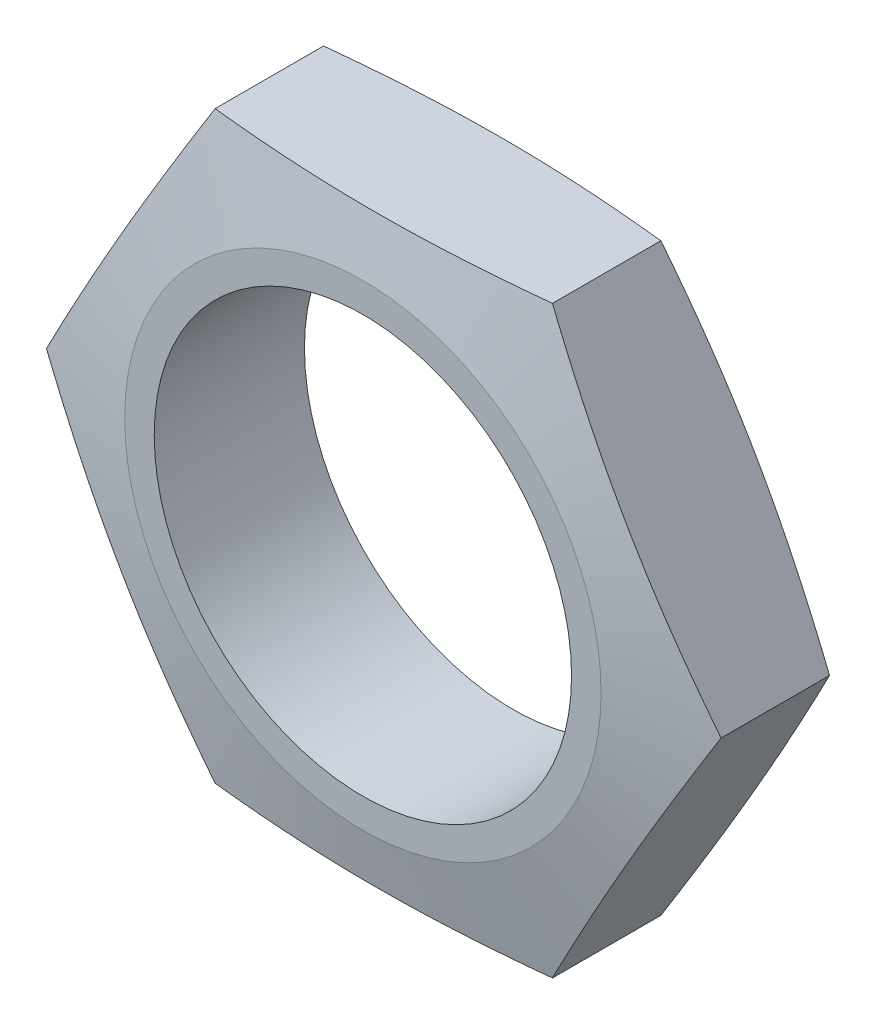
ISO-10303-21;
HEADER;
FILE_DESCRIPTION(('STEP AP214'),'2;1');
FILE_NAME('part.step','',(''),(''),'','','');
FILE_SCHEMA(('AUTOMOTIVE_DESIGN { 1 0 10303 214 1 1 1 1 }'));
ENDSEC;
DATA;
#1=APPLICATION_CONTEXT('core data for automotive mechanical design processes');
#2=APPLICATION_PROTOCOL_DEFINITION('international standard','automotive_design',2000,#1);
#3=PRODUCT_CONTEXT('',#1,'mechanical');
#4=PRODUCT('Part','Part','',(#3));
#5=PRODUCT_RELATED_PRODUCT_CATEGORY('part','',(#4));
#6=PRODUCT_DEFINITION_FORMATION('','',#4);
#7=PRODUCT_DEFINITION_CONTEXT('part definition',#1,'design');
#8=PRODUCT_DEFINITION('design','',#6,#7);
#9=PRODUCT_DEFINITION_SHAPE('','',#8);
#10=(LENGTH_UNIT() NAMED_UNIT(*) SI_UNIT(.MILLI.,.METRE.));
#11=(NAMED_UNIT(*) PLANE_ANGLE_UNIT() SI_UNIT($,.RADIAN.));
#12=(NAMED_UNIT(*) SI_UNIT($,.STERADIAN.) SOLID_ANGLE_UNIT());
#13=UNCERTAINTY_MEASURE_WITH_UNIT(LENGTH_MEASURE(1.E-05),#10,'distance_accuracy_value','');
#14=(GEOMETRIC_REPRESENTATION_CONTEXT(3) GLOBAL_UNCERTAINTY_ASSIGNED_CONTEXT((#13)) GLOBAL_UNIT_ASSIGNED_CONTEXT((#10,
#11,#12)) REPRESENTATION_CONTEXT('',''));
#15=CARTESIAN_POINT('',(0.,0.,0.));
#16=DIRECTION('',(0.,0.,1.));
#17=DIRECTION('',(1.,0.,0.));
#18=AXIS2_PLACEMENT_3D('',#15,#16,#17);
#19=CARTESIAN_POINT('',(-5.13264389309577,-8.89,2.286));
#20=DIRECTION('',(0.,1.,0.));
#21=DIRECTION('',(0.,0.,1.));
#22=AXIS2_PLACEMENT_3D('',#19,#20,#21);
#23=PLANE('',#22);
#24=CARTESIAN_POINT('',(-13.5389504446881,-8.89,0.398716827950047));
#25=CARTESIAN_POINT('',(-13.13577838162,-8.89,0.469772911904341));
#26=CARTESIAN_POINT('',(-12.7324462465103,-8.89,0.539936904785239));
#27=CARTESIAN_POINT('',(-11.9253845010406,-8.89,0.678005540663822));
#28=CARTESIAN_POINT('',(-11.5216548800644,-8.89,0.74591012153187));
#29=CARTESIAN_POINT('',(-10.7134952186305,-8.89,0.879021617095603));
#30=CARTESIAN_POINT('',(-10.309064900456,-8.89,0.944226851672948));
#31=CARTESIAN_POINT('',(-9.49967433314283,-8.89,1.07125883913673));
#32=CARTESIAN_POINT('',(-9.09471408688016,-8.89,1.13308561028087));
#33=CARTESIAN_POINT('',(-8.2861498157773,-8.89,1.25228035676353));
#34=CARTESIAN_POINT('',(-7.88254879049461,-8.89,1.30966858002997));
#35=CARTESIAN_POINT('',(-7.07465636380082,-8.89,1.4193512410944));
#36=CARTESIAN_POINT('',(-6.67036497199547,-8.89,1.47164574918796));
#37=CARTESIAN_POINT('',(-5.86104887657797,-8.89,1.56997388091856));
#38=CARTESIAN_POINT('',(-5.45602423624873,-8.89,1.6160080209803));
#39=CARTESIAN_POINT('',(-4.64517476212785,-8.89,1.70047798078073));
#40=CARTESIAN_POINT('',(-4.23934992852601,-8.89,1.73891380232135));
#41=CARTESIAN_POINT('',(-3.42416088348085,-8.89,1.80698098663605));
#42=CARTESIAN_POINT('',(-3.01479142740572,-8.89,1.83655043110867));
#43=CARTESIAN_POINT('',(-2.19542155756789,-8.89,1.88514118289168));
#44=CARTESIAN_POINT('',(-1.78542115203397,-8.89,1.90416262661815));
#45=CARTESIAN_POINT('',(-0.965148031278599,-8.89,1.9306064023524));
#46=CARTESIAN_POINT('',(-0.554875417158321,-8.89,1.93803181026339));
#47=CARTESIAN_POINT('',(0.265711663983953,-8.89,1.94084566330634));
#48=CARTESIAN_POINT('',(0.676026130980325,-8.89,1.93623411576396));
#49=CARTESIAN_POINT('',(1.49727621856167,-8.89,1.91523087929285));
#50=CARTESIAN_POINT('',(1.90821114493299,-8.89,1.89881256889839));
#51=CARTESIAN_POINT('',(2.72949672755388,-8.89,1.85509983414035));
#52=CARTESIAN_POINT('',(3.13984737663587,-8.89,1.82780527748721));
#53=CARTESIAN_POINT('',(3.95994678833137,-8.89,1.76367016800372));
#54=CARTESIAN_POINT('',(4.36969526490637,-8.89,1.72682601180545));
#55=CARTESIAN_POINT('',(5.18837857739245,-8.89,1.64507569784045));
#56=CARTESIAN_POINT('',(5.59731341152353,-8.89,1.60016952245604));
#57=CARTESIAN_POINT('',(6.39205589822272,-8.89,1.50634278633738));
#58=CARTESIAN_POINT('',(6.77790571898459,-8.89,1.45777589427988));
#59=CARTESIAN_POINT('',(7.54896076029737,-8.89,1.35574653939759));
#60=CARTESIAN_POINT('',(7.9341659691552,-8.89,1.3022839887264));
#61=CARTESIAN_POINT('',(8.70401923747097,-8.89,1.19134899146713));
#62=CARTESIAN_POINT('',(9.08866726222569,-8.89,1.13387630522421));
#63=CARTESIAN_POINT('',(9.85745933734,-8.89,1.0156457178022));
#64=CARTESIAN_POINT('',(10.2416033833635,-8.89,0.954887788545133));
#65=CARTESIAN_POINT('',(11.3935270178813,-8.89,0.768578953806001));
#66=CARTESIAN_POINT('',(12.1606566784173,-8.89,0.639013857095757));
#67=CARTESIAN_POINT('',(13.6936094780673,-8.89,0.372617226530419));
#68=CARTESIAN_POINT('',(14.4594326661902,-8.89,0.235785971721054));
#69=CARTESIAN_POINT('',(15.9854281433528,-8.89,-0.0421323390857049));
#70=CARTESIAN_POINT('',(16.7456061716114,-8.89,-0.183187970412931));
#71=CARTESIAN_POINT('',(18.2652832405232,-8.89,-0.468948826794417));
#72=CARTESIAN_POINT('',(19.024782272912,-8.89,-0.613654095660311));
#73=CARTESIAN_POINT('',(20.5426135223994,-8.89,-0.905631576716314));
#74=CARTESIAN_POINT('',(21.3009461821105,-8.89,-1.05290149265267));
#75=CARTESIAN_POINT('',(22.8171895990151,-8.89,-1.34951165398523));
#76=CARTESIAN_POINT('',(23.5751003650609,-8.89,-1.49885185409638));
#77=CARTESIAN_POINT('',(24.3328647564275,-8.89,-1.64892209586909));
#78=B_SPLINE_CURVE_WITH_KNOTS('',3,(#24,#25,#26,#27,#28,#29,#30,#31,#32,#33,#34,#35,#36,#37,#38,
#39,#40,#41,#42,#43,#44,#45,#46,#47,#48,#49,#50,#51,#52,#53,#54,#55,#56,#57,#58,#59,#60,#61,#62,
#63,#64,#65,#66,#67,#68,#69,#70,#71,#72,#73,#74,#75,#76,#77),.UNSPECIFIED.,.F.,.F.,(4,2,2,2,2,2,
2,2,2,2,2,2,2,2,2,2,2,2,2,2,2,2,2,2,2,2,4),(0.,1.22816040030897,2.45635454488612,
3.68530198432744,4.91424278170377,6.13719865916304,7.36013765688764,8.58297571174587,
9.80581347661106,11.0370020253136,12.2681746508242,13.4990206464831,14.7298658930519,
15.9634951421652,17.1971393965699,18.431249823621,19.6653629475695,20.8320090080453,
21.9986760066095,23.1654127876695,24.332159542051,26.6660818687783,28.9999146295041,
31.3193643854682,33.6388419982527,35.9563399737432,38.2737873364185),.UNSPECIFIED.);
#79=CARTESIAN_POINT('',(-5.13264389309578,-8.89,1.64964364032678));
#80=VERTEX_POINT('',#79);
#81=CARTESIAN_POINT('',(5.13264389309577,-8.89,1.64964364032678));
#82=VERTEX_POINT('',#81);
#83=EDGE_CURVE('E208',#80,#82,#78,.T.);
#84=ORIENTED_EDGE('',*,*,#83,.F.);
#85=DIRECTION('',(0.,0.,-1.));
#86=VECTOR('',#85,1.);
#87=CARTESIAN_POINT('',(-5.13264389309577,-8.89,2.286));
#88=LINE('',#87,#86);
#89=CARTESIAN_POINT('',(-5.13264389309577,-8.89,-1.64964364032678));
#90=VERTEX_POINT('',#89);
#91=EDGE_CURVE('E64',#80,#90,#88,.T.);
#92=ORIENTED_EDGE('',*,*,#91,.T.);
#93=CARTESIAN_POINT('',(-13.5389504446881,-8.89,-0.398716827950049));
#94=CARTESIAN_POINT('',(-13.13577838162,-8.89,-0.469772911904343));
#95=CARTESIAN_POINT('',(-12.7324462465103,-8.89,-0.539936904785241));
#96=CARTESIAN_POINT('',(-11.9253845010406,-8.89,-0.678005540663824));
#97=CARTESIAN_POINT('',(-11.5216548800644,-8.89,-0.745910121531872));
#98=CARTESIAN_POINT('',(-10.7134952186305,-8.89,-0.879021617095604));
#99=CARTESIAN_POINT('',(-10.309064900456,-8.89,-0.944226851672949));
#100=CARTESIAN_POINT('',(-9.49967433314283,-8.89,-1.07125883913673));
#101=CARTESIAN_POINT('',(-9.09471408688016,-8.89,-1.13308561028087));
#102=CARTESIAN_POINT('',(-8.2861498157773,-8.89,-1.25228035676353));
#103=CARTESIAN_POINT('',(-7.88254879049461,-8.89,-1.30966858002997));
#104=CARTESIAN_POINT('',(-7.07465636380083,-8.89,-1.4193512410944));
#105=CARTESIAN_POINT('',(-6.67036497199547,-8.89,-1.47164574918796));
#106=CARTESIAN_POINT('',(-5.86104887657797,-8.89,-1.56997388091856));
#107=CARTESIAN_POINT('',(-5.45602423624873,-8.89,-1.6160080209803));
#108=CARTESIAN_POINT('',(-4.64517476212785,-8.89,-1.70047798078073));
#109=CARTESIAN_POINT('',(-4.23934992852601,-8.89,-1.73891380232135));
#110=CARTESIAN_POINT('',(-3.42416088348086,-8.89,-1.80698098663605));
#111=CARTESIAN_POINT('',(-3.01479142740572,-8.89,-1.83655043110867));
#112=CARTESIAN_POINT('',(-2.1954215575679,-8.89,-1.88514118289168));
#113=CARTESIAN_POINT('',(-1.78542115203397,-8.89,-1.90416262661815));
#114=CARTESIAN_POINT('',(-0.9651480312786,-8.89,-1.9306064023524));
#115=CARTESIAN_POINT('',(-0.554875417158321,-8.89,-1.93803181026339));
#116=CARTESIAN_POINT('',(0.265711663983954,-8.89,-1.94084566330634));
#117=CARTESIAN_POINT('',(0.676026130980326,-8.89,-1.93623411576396));
#118=CARTESIAN_POINT('',(1.49727621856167,-8.89,-1.91523087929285));
#119=CARTESIAN_POINT('',(1.90821114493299,-8.89,-1.89881256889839));
#120=CARTESIAN_POINT('',(2.72949672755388,-8.89,-1.85509983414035));
#121=CARTESIAN_POINT('',(3.13984737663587,-8.89,-1.82780527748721));
#122=CARTESIAN_POINT('',(3.95994678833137,-8.89,-1.76367016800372));
#123=CARTESIAN_POINT('',(4.36969526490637,-8.89,-1.72682601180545));
#124=CARTESIAN_POINT('',(5.18837857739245,-8.89,-1.64507569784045));
#125=CARTESIAN_POINT('',(5.59731341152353,-8.89,-1.60016952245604));
#126=CARTESIAN_POINT('',(6.39205589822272,-8.89,-1.50634278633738));
#127=CARTESIAN_POINT('',(6.77790571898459,-8.89,-1.45777589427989));
#128=CARTESIAN_POINT('',(7.54896076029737,-8.89,-1.35574653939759));
#129=CARTESIAN_POINT('',(7.9341659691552,-8.89,-1.3022839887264));
#130=CARTESIAN_POINT('',(8.70401923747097,-8.89,-1.19134899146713));
#131=CARTESIAN_POINT('',(9.08866726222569,-8.89,-1.13387630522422));
#132=CARTESIAN_POINT('',(9.85745933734,-8.89,-1.0156457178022));
#133=CARTESIAN_POINT('',(10.2416033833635,-8.89,-0.954887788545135));
#134=CARTESIAN_POINT('',(11.3935270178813,-8.89,-0.768578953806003));
#135=CARTESIAN_POINT('',(12.1606566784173,-8.89,-0.639013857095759));
#136=CARTESIAN_POINT('',(13.6936094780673,-8.89,-0.372617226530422));
#137=CARTESIAN_POINT('',(14.4594326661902,-8.89,-0.235785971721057));
#138=CARTESIAN_POINT('',(15.9854281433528,-8.89,0.0421323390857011));
#139=CARTESIAN_POINT('',(16.7456061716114,-8.89,0.183187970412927));
#140=CARTESIAN_POINT('',(18.2652832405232,-8.89,0.468948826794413));
#141=CARTESIAN_POINT('',(19.024782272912,-8.89,0.613654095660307));
#142=CARTESIAN_POINT('',(20.5426135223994,-8.89,0.90563157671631));
#143=CARTESIAN_POINT('',(21.3009461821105,-8.89,1.05290149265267));
#144=CARTESIAN_POINT('',(22.8171895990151,-8.89,1.34951165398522));
#145=CARTESIAN_POINT('',(23.5751003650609,-8.89,1.49885185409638));
#146=CARTESIAN_POINT('',(24.3328647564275,-8.89,1.64892209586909));
#147=B_SPLINE_CURVE_WITH_KNOTS('',3,(#93,#94,#95,#96,#97,#98,#99,#100,#101,#102,#103,#104,#105,
#106,#107,#108,#109,#110,#111,#112,#113,#114,#115,#116,#117,#118,#119,#120,#121,#122,#123,#124,
#125,#126,#127,#128,#129,#130,#131,#132,#133,#134,#135,#136,#137,#138,#139,#140,#141,#142,#143,
#144,#145,#146),.UNSPECIFIED.,.F.,.F.,(4,2,2,2,2,2,2,2,2,2,2,2,2,2,2,2,2,2,2,2,2,2,2,2,2,2,4),
(0.,1.22816040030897,2.45635454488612,3.68530198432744,4.91424278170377,6.13719865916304,
7.36013765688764,8.58297571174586,9.80581347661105,11.0370020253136,12.2681746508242,
13.4990206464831,14.7298658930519,15.9634951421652,17.1971393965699,18.431249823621,
19.6653629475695,20.8320090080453,21.9986760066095,23.1654127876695,24.332159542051,
26.6660818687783,28.9999146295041,31.3193643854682,33.6388419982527,35.9563399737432,
38.2737873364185),.UNSPECIFIED.);
#148=CARTESIAN_POINT('',(5.13264389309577,-8.89,-1.64964364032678));
#149=VERTEX_POINT('',#148);
#150=EDGE_CURVE('E134',#149,#90,#147,.F.);
#151=ORIENTED_EDGE('',*,*,#150,.F.);
#152=DIRECTION('',(0.,0.,-1.));
#153=VECTOR('',#152,1.);
#154=CARTESIAN_POINT('',(5.13264389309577,-8.89,2.286));
#155=LINE('',#154,#153);
#156=EDGE_CURVE('E49',#82,#149,#155,.T.);
#157=ORIENTED_EDGE('',*,*,#156,.F.);
#158=EDGE_LOOP('',(#84,#92,#151,#157));
#159=FACE_BOUND('',#158,.T.);
#160=ADVANCED_FACE('F35',(#159),#23,.F.);
#161=CARTESIAN_POINT('',(5.13264389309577,-8.89,2.286));
#162=DIRECTION('',(-0.866025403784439,0.5,0.));
#163=DIRECTION('',(-0.5,-0.866025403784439,0.));
#164=AXIS2_PLACEMENT_3D('',#161,#162,#163);
#165=PLANE('',#164);
#166=CARTESIAN_POINT('',(5.13252842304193,-8.8902,1.64961928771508));
#167=CARTESIAN_POINT('',(5.34595380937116,-8.52053638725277,1.69464932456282));
#168=CARTESIAN_POINT('',(5.55962047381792,-8.1504548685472,1.73549140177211));
#169=CARTESIAN_POINT('',(5.98742170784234,-7.40948139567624,1.80720215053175));
#170=CARTESIAN_POINT('',(6.20155637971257,-7.03858926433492,1.83806836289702));
#171=CARTESIAN_POINT('',(6.62948643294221,-6.29739267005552,1.88812572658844));
#172=CARTESIAN_POINT('',(6.84328069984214,-5.9270901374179,1.90735400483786));
#173=CARTESIAN_POINT('',(7.27103860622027,-5.1861917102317,1.93313373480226));
#174=CARTESIAN_POINT('',(7.48500222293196,-4.81559585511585,1.93968667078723));
#175=CARTESIAN_POINT('',(7.91292945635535,-4.07440414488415,1.93968667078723));
#176=CARTESIAN_POINT('',(8.12689307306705,-3.7038082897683,1.93313373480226));
#177=CARTESIAN_POINT('',(8.55465097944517,-2.96290986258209,1.90735400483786));
#178=CARTESIAN_POINT('',(8.7684452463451,-2.59260732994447,1.88812572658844));
#179=CARTESIAN_POINT('',(9.19637529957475,-1.85141073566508,1.83806836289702));
#180=CARTESIAN_POINT('',(9.41050997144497,-1.48051860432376,1.80720215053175));
#181=CARTESIAN_POINT('',(9.83831120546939,-0.739545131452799,1.73549140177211));
#182=CARTESIAN_POINT('',(10.0519778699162,-0.369463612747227,1.69464932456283));
#183=CARTESIAN_POINT('',(10.2654032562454,0.000200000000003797,1.64961928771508));
#184=B_SPLINE_CURVE_WITH_KNOTS('',3,(#166,#167,#168,#169,#170,#171,#172,#173,#174,#175,#176,
#177,#178,#179,#180,#181,#182,#183),.UNSPECIFIED.,.F.,.F.,(4,2,2,2,2,2,2,2,4),(0.,
1.28769865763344,2.57571450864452,3.85959941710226,5.14333397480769,6.42706853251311,
7.71095344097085,8.99896929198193,10.2866679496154),.UNSPECIFIED.);
#185=CARTESIAN_POINT('',(10.2652877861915,0.,1.64964364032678));
#186=VERTEX_POINT('',#185);
#187=EDGE_CURVE('E130',#82,#186,#184,.T.);
#188=ORIENTED_EDGE('',*,*,#187,.F.);
#189=ORIENTED_EDGE('',*,*,#156,.T.);
#190=CARTESIAN_POINT('',(10.2654032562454,0.00020000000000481,-1.64961928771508));
#191=CARTESIAN_POINT('',(10.0519778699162,-0.369463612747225,-1.69464932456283));
#192=CARTESIAN_POINT('',(9.83831120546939,-0.739545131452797,-1.73549140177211));
#193=CARTESIAN_POINT('',(9.41050997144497,-1.48051860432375,-1.80720215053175));
#194=CARTESIAN_POINT('',(9.19637529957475,-1.85141073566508,-1.83806836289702));
#195=CARTESIAN_POINT('',(8.76844524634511,-2.59260732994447,-1.88812572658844));
#196=CARTESIAN_POINT('',(8.55465097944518,-2.96290986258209,-1.90735400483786));
#197=CARTESIAN_POINT('',(8.12689307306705,-3.7038082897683,-1.93313373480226));
#198=CARTESIAN_POINT('',(7.91292945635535,-4.07440414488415,-1.93968667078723));
#199=CARTESIAN_POINT('',(7.48500222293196,-4.81559585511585,-1.93968667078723));
#200=CARTESIAN_POINT('',(7.27103860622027,-5.1861917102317,-1.93313373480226));
#201=CARTESIAN_POINT('',(6.84328069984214,-5.92709013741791,-1.90735400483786));
#202=CARTESIAN_POINT('',(6.62948643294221,-6.29739267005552,-1.88812572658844));
#203=CARTESIAN_POINT('',(6.20155637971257,-7.03858926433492,-1.83806836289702));
#204=CARTESIAN_POINT('',(5.98742170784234,-7.40948139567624,-1.80720215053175));
#205=CARTESIAN_POINT('',(5.55962047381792,-8.1504548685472,-1.73549140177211));
#206=CARTESIAN_POINT('',(5.34595380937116,-8.52053638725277,-1.69464932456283));
#207=CARTESIAN_POINT('',(5.13252842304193,-8.8902,-1.64961928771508));
#208=B_SPLINE_CURVE_WITH_KNOTS('',3,(#190,#191,#192,#193,#194,#195,#196,#197,#198,#199,#200,
#201,#202,#203,#204,#205,#206,#207),.UNSPECIFIED.,.F.,.F.,(4,2,2,2,2,2,2,2,4),(0.,
1.28769865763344,2.57571450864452,3.85959941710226,5.14333397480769,6.42706853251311,
7.71095344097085,8.99896929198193,10.2866679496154),.UNSPECIFIED.);
#209=CARTESIAN_POINT('',(10.2652877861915,0.,-1.64964364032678));
#210=VERTEX_POINT('',#209);
#211=EDGE_CURVE('E129',#210,#149,#208,.T.);
#212=ORIENTED_EDGE('',*,*,#211,.F.);
#213=DIRECTION('',(0.,0.,-1.));
#214=VECTOR('',#213,1.);
#215=CARTESIAN_POINT('',(10.2652877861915,0.,2.286));
#216=LINE('',#215,#214);
#217=EDGE_CURVE('E117',#186,#210,#216,.T.);
#218=ORIENTED_EDGE('',*,*,#217,.F.);
#219=EDGE_LOOP('',(#188,#189,#212,#218));
#220=FACE_BOUND('',#219,.T.);
#221=ADVANCED_FACE('F127',(#220),#165,.F.);
#222=CARTESIAN_POINT('',(10.2652877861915,0.,2.286));
#223=DIRECTION('',(-0.866025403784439,-0.5,0.));
#224=DIRECTION('',(0.5,-0.866025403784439,0.));
#225=AXIS2_PLACEMENT_3D('',#222,#223,#224);
#226=PLANE('',#225);
#227=CARTESIAN_POINT('',(10.2654032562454,-0.000199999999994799,1.64961928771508));
#228=CARTESIAN_POINT('',(10.0519778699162,0.369463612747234,1.69464932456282));
#229=CARTESIAN_POINT('',(9.83831120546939,0.739545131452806,1.73549140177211));
#230=CARTESIAN_POINT('',(9.41050997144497,1.48051860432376,1.80720215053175));
#231=CARTESIAN_POINT('',(9.19637529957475,1.85141073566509,1.83806836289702));
#232=CARTESIAN_POINT('',(8.76844524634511,2.59260732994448,1.88812572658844));
#233=CARTESIAN_POINT('',(8.55465097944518,2.9629098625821,1.90735400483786));
#234=CARTESIAN_POINT('',(8.12689307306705,3.7038082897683,1.93313373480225));
#235=CARTESIAN_POINT('',(7.91292945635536,4.07440414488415,1.93968667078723));
#236=CARTESIAN_POINT('',(7.48500222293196,4.81559585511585,1.93968667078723));
#237=CARTESIAN_POINT('',(7.27103860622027,5.1861917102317,1.93313373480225));
#238=CARTESIAN_POINT('',(6.84328069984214,5.92709013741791,1.90735400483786));
#239=CARTESIAN_POINT('',(6.62948643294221,6.29739267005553,1.88812572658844));
#240=CARTESIAN_POINT('',(6.20155637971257,7.03858926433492,1.83806836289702));
#241=CARTESIAN_POINT('',(5.98742170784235,7.40948139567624,1.80720215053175));
#242=CARTESIAN_POINT('',(5.55962047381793,8.1504548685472,1.73549140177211));
#243=CARTESIAN_POINT('',(5.34595380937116,8.52053638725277,1.69464932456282));
#244=CARTESIAN_POINT('',(5.13252842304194,8.8902,1.64961928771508));
#245=B_SPLINE_CURVE_WITH_KNOTS('',3,(#227,#228,#229,#230,#231,#232,#233,#234,#235,#236,#237,
#238,#239,#240,#241,#242,#243,#244),.UNSPECIFIED.,.F.,.F.,(4,2,2,2,2,2,2,2,4),(0.,
1.28769865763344,2.57571450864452,3.85959941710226,5.14333397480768,6.42706853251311,
7.71095344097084,8.99896929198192,10.2866679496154),.UNSPECIFIED.);
#246=CARTESIAN_POINT('',(5.13264389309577,8.89,1.64964364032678));
#247=VERTEX_POINT('',#246);
#248=EDGE_CURVE('E97',#186,#247,#245,.T.);
#249=ORIENTED_EDGE('',*,*,#248,.F.);
#250=ORIENTED_EDGE('',*,*,#217,.T.);
#251=CARTESIAN_POINT('',(5.13252842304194,8.8902,-1.64961928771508));
#252=CARTESIAN_POINT('',(5.34595380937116,8.52053638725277,-1.69464932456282));
#253=CARTESIAN_POINT('',(5.55962047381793,8.1504548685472,-1.73549140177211));
#254=CARTESIAN_POINT('',(5.98742170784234,7.40948139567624,-1.80720215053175));
#255=CARTESIAN_POINT('',(6.20155637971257,7.03858926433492,-1.83806836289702));
#256=CARTESIAN_POINT('',(6.62948643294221,6.29739267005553,-1.88812572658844));
#257=CARTESIAN_POINT('',(6.84328069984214,5.92709013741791,-1.90735400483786));
#258=CARTESIAN_POINT('',(7.27103860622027,5.1861917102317,-1.93313373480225));
#259=CARTESIAN_POINT('',(7.48500222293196,4.81559585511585,-1.93968667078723));
#260=CARTESIAN_POINT('',(7.91292945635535,4.07440414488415,-1.93968667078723));
#261=CARTESIAN_POINT('',(8.12689307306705,3.7038082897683,-1.93313373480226));
#262=CARTESIAN_POINT('',(8.55465097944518,2.9629098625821,-1.90735400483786));
#263=CARTESIAN_POINT('',(8.7684452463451,2.59260732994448,-1.88812572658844));
#264=CARTESIAN_POINT('',(9.19637529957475,1.85141073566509,-1.83806836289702));
#265=CARTESIAN_POINT('',(9.41050997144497,1.48051860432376,-1.80720215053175));
#266=CARTESIAN_POINT('',(9.83831120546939,0.739545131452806,-1.73549140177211));
#267=CARTESIAN_POINT('',(10.0519778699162,0.369463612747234,-1.69464932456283));
#268=CARTESIAN_POINT('',(10.2654032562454,-0.000199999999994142,-1.64961928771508));
#269=B_SPLINE_CURVE_WITH_KNOTS('',3,(#251,#252,#253,#254,#255,#256,#257,#258,#259,#260,#261,
#262,#263,#264,#265,#266,#267,#268),.UNSPECIFIED.,.F.,.F.,(4,2,2,2,2,2,2,2,4),(0.,
1.28769865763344,2.57571450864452,3.85959941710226,5.14333397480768,6.4270685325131,
7.71095344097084,8.99896929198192,10.2866679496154),.UNSPECIFIED.);
#270=CARTESIAN_POINT('',(5.13264389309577,8.89,-1.64964364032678));
#271=VERTEX_POINT('',#270);
#272=EDGE_CURVE('E137',#271,#210,#269,.T.);
#273=ORIENTED_EDGE('',*,*,#272,.F.);
#274=DIRECTION('',(0.,0.,-1.));
#275=VECTOR('',#274,1.);
#276=CARTESIAN_POINT('',(5.13264389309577,8.89,2.286));
#277=LINE('',#276,#275);
#278=EDGE_CURVE('E115',#247,#271,#277,.T.);
#279=ORIENTED_EDGE('',*,*,#278,.F.);
#280=EDGE_LOOP('',(#249,#250,#273,#279));
#281=FACE_BOUND('',#280,.T.);
#282=ADVANCED_FACE('F186',(#281),#226,.F.);
#283=CARTESIAN_POINT('',(5.13264389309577,8.89,2.286));
#284=DIRECTION('',(0.,-1.,0.));
#285=DIRECTION('',(0.,0.,-1.));
#286=AXIS2_PLACEMENT_3D('',#283,#284,#285);
#287=PLANE('',#286);
#288=CARTESIAN_POINT('',(-13.5389504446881,8.89,0.398716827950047));
#289=CARTESIAN_POINT('',(-13.13577838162,8.89,0.469772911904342));
#290=CARTESIAN_POINT('',(-12.7324462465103,8.89,0.53993690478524));
#291=CARTESIAN_POINT('',(-11.9253845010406,8.89,0.678005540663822));
#292=CARTESIAN_POINT('',(-11.5216548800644,8.89,0.74591012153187));
#293=CARTESIAN_POINT('',(-10.7134952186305,8.89,0.879021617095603));
#294=CARTESIAN_POINT('',(-10.309064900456,8.89,0.944226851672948));
#295=CARTESIAN_POINT('',(-9.49967433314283,8.89,1.07125883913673));
#296=CARTESIAN_POINT('',(-9.09471408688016,8.89,1.13308561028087));
#297=CARTESIAN_POINT('',(-8.2861498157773,8.89,1.25228035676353));
#298=CARTESIAN_POINT('',(-7.88254879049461,8.89,1.30966858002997));
#299=CARTESIAN_POINT('',(-7.07465636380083,8.89,1.4193512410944));
#300=CARTESIAN_POINT('',(-6.67036497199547,8.89,1.47164574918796));
#301=CARTESIAN_POINT('',(-5.86104887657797,8.89,1.56997388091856));
#302=CARTESIAN_POINT('',(-5.45602423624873,8.89,1.6160080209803));
#303=CARTESIAN_POINT('',(-4.64517476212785,8.89,1.70047798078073));
#304=CARTESIAN_POINT('',(-4.23934992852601,8.89,1.73891380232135));
#305=CARTESIAN_POINT('',(-3.42416088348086,8.89,1.80698098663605));
#306=CARTESIAN_POINT('',(-3.01479142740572,8.89,1.83655043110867));
#307=CARTESIAN_POINT('',(-2.1954215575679,8.89,1.88514118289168));
#308=CARTESIAN_POINT('',(-1.78542115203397,8.89,1.90416262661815));
#309=CARTESIAN_POINT('',(-0.965148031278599,8.89,1.9306064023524));
#310=CARTESIAN_POINT('',(-0.55487541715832,8.89,1.93803181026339));
#311=CARTESIAN_POINT('',(0.265711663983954,8.89,1.94084566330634));
#312=CARTESIAN_POINT('',(0.676026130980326,8.89,1.93623411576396));
#313=CARTESIAN_POINT('',(1.49727621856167,8.89,1.91523087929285));
#314=CARTESIAN_POINT('',(1.90821114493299,8.89,1.89881256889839));
#315=CARTESIAN_POINT('',(2.72949672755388,8.89,1.85509983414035));
#316=CARTESIAN_POINT('',(3.13984737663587,8.89,1.82780527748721));
#317=CARTESIAN_POINT('',(3.95994678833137,8.89,1.76367016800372));
#318=CARTESIAN_POINT('',(4.36969526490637,8.89,1.72682601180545));
#319=CARTESIAN_POINT('',(5.18837857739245,8.89,1.64507569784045));
#320=CARTESIAN_POINT('',(5.59731341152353,8.89,1.60016952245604));
#321=CARTESIAN_POINT('',(6.39205589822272,8.89,1.50634278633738));
#322=CARTESIAN_POINT('',(6.77790571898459,8.89,1.45777589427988));
#323=CARTESIAN_POINT('',(7.54896076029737,8.89,1.35574653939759));
#324=CARTESIAN_POINT('',(7.9341659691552,8.89,1.3022839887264));
#325=CARTESIAN_POINT('',(8.70401923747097,8.89,1.19134899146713));
#326=CARTESIAN_POINT('',(9.08866726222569,8.89,1.13387630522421));
#327=CARTESIAN_POINT('',(9.85745933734,8.89,1.0156457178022));
#328=CARTESIAN_POINT('',(10.2416033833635,8.89,0.954887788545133));
#329=CARTESIAN_POINT('',(11.3935270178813,8.89,0.768578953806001));
#330=CARTESIAN_POINT('',(12.1606566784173,8.89,0.639013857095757));
#331=CARTESIAN_POINT('',(13.6936094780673,8.89,0.37261722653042));
#332=CARTESIAN_POINT('',(14.4594326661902,8.89,0.235785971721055));
#333=CARTESIAN_POINT('',(15.9854281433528,8.89,-0.0421323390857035));
#334=CARTESIAN_POINT('',(16.7456061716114,8.89,-0.18318797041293));
#335=CARTESIAN_POINT('',(18.2652832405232,8.89,-0.468948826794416));
#336=CARTESIAN_POINT('',(19.024782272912,8.89,-0.613654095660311));
#337=CARTESIAN_POINT('',(20.5426135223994,8.89,-0.905631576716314));
#338=CARTESIAN_POINT('',(21.3009461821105,8.89,-1.05290149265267));
#339=CARTESIAN_POINT('',(22.8171895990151,8.89,-1.34951165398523));
#340=CARTESIAN_POINT('',(23.5751003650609,8.89,-1.49885185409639));
#341=CARTESIAN_POINT('',(24.3328647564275,8.89,-1.64892209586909));
#342=B_SPLINE_CURVE_WITH_KNOTS('',3,(#288,#289,#290,#291,#292,#293,#294,#295,#296,#297,#298,
#299,#300,#301,#302,#303,#304,#305,#306,#307,#308,#309,#310,#311,#312,#313,#314,#315,#316,#317,
#318,#319,#320,#321,#322,#323,#324,#325,#326,#327,#328,#329,#330,#331,#332,#333,#334,#335,#336,
#337,#338,#339,#340,#341),.UNSPECIFIED.,.F.,.F.,(4,2,2,2,2,2,2,2,2,2,2,2,2,2,2,2,2,2,2,2,2,2,2,
2,2,2,4),(0.,1.22816040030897,2.45635454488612,3.68530198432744,4.91424278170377,
6.13719865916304,7.36013765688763,8.58297571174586,9.80581347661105,11.0370020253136,
12.2681746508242,13.4990206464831,14.7298658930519,15.9634951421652,17.1971393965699,
18.431249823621,19.6653629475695,20.8320090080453,21.9986760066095,23.1654127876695,
24.332159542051,26.6660818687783,28.9999146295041,31.3193643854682,33.6388419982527,
35.9563399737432,38.2737873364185),.UNSPECIFIED.);
#343=CARTESIAN_POINT('',(-5.13264389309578,8.89,1.64964364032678));
#344=VERTEX_POINT('',#343);
#345=EDGE_CURVE('E94',#247,#344,#342,.F.);
#346=ORIENTED_EDGE('',*,*,#345,.F.);
#347=ORIENTED_EDGE('',*,*,#278,.T.);
#348=CARTESIAN_POINT('',(-13.5389504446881,8.89,-0.39871682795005));
#349=CARTESIAN_POINT('',(-13.13577838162,8.89,-0.469772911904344));
#350=CARTESIAN_POINT('',(-12.7324462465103,8.89,-0.539936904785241));
#351=CARTESIAN_POINT('',(-11.9253845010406,8.89,-0.678005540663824));
#352=CARTESIAN_POINT('',(-11.5216548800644,8.89,-0.745910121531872));
#353=CARTESIAN_POINT('',(-10.7134952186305,8.89,-0.879021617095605));
#354=CARTESIAN_POINT('',(-10.309064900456,8.89,-0.944226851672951));
#355=CARTESIAN_POINT('',(-9.49967433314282,8.89,-1.07125883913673));
#356=CARTESIAN_POINT('',(-9.09471408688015,8.89,-1.13308561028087));
#357=CARTESIAN_POINT('',(-8.28614981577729,8.89,-1.25228035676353));
#358=CARTESIAN_POINT('',(-7.8825487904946,8.89,-1.30966858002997));
#359=CARTESIAN_POINT('',(-7.07465636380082,8.89,-1.4193512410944));
#360=CARTESIAN_POINT('',(-6.67036497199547,8.89,-1.47164574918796));
#361=CARTESIAN_POINT('',(-5.86104887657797,8.89,-1.56997388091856));
#362=CARTESIAN_POINT('',(-5.45602423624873,8.89,-1.6160080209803));
#363=CARTESIAN_POINT('',(-4.64517476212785,8.89,-1.70047798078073));
#364=CARTESIAN_POINT('',(-4.23934992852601,8.89,-1.73891380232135));
#365=CARTESIAN_POINT('',(-3.42416088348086,8.89,-1.80698098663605));
#366=CARTESIAN_POINT('',(-3.01479142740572,8.89,-1.83655043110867));
#367=CARTESIAN_POINT('',(-2.1954215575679,8.89,-1.88514118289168));
#368=CARTESIAN_POINT('',(-1.78542115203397,8.89,-1.90416262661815));
#369=CARTESIAN_POINT('',(-0.965148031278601,8.89,-1.9306064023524));
#370=CARTESIAN_POINT('',(-0.554875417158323,8.89,-1.93803181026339));
#371=CARTESIAN_POINT('',(0.265711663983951,8.89,-1.94084566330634));
#372=CARTESIAN_POINT('',(0.676026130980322,8.89,-1.93623411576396));
#373=CARTESIAN_POINT('',(1.49727621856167,8.89,-1.91523087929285));
#374=CARTESIAN_POINT('',(1.90821114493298,8.89,-1.89881256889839));
#375=CARTESIAN_POINT('',(2.72949672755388,8.89,-1.85509983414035));
#376=CARTESIAN_POINT('',(3.13984737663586,8.89,-1.82780527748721));
#377=CARTESIAN_POINT('',(3.95994678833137,8.89,-1.76367016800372));
#378=CARTESIAN_POINT('',(4.36969526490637,8.89,-1.72682601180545));
#379=CARTESIAN_POINT('',(5.18837857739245,8.89,-1.64507569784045));
#380=CARTESIAN_POINT('',(5.59731341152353,8.89,-1.60016952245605));
#381=CARTESIAN_POINT('',(6.39205589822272,8.89,-1.50634278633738));
#382=CARTESIAN_POINT('',(6.77790571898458,8.89,-1.45777589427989));
#383=CARTESIAN_POINT('',(7.54896076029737,8.89,-1.35574653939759));
#384=CARTESIAN_POINT('',(7.9341659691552,8.89,-1.3022839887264));
#385=CARTESIAN_POINT('',(8.70401923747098,8.89,-1.19134899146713));
#386=CARTESIAN_POINT('',(9.0886672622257,8.89,-1.13387630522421));
#387=CARTESIAN_POINT('',(9.85745933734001,8.89,-1.0156457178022));
#388=CARTESIAN_POINT('',(10.2416033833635,8.89,-0.954887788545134));
#389=CARTESIAN_POINT('',(11.3935270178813,8.89,-0.768578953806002));
#390=CARTESIAN_POINT('',(12.1606566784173,8.89,-0.639013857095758));
#391=CARTESIAN_POINT('',(13.6936094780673,8.89,-0.37261722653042));
#392=CARTESIAN_POINT('',(14.4594326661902,8.89,-0.235785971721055));
#393=CARTESIAN_POINT('',(15.9854281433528,8.89,0.0421323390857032));
#394=CARTESIAN_POINT('',(16.7456061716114,8.89,0.183187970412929));
#395=CARTESIAN_POINT('',(18.2652832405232,8.89,0.468948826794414));
#396=CARTESIAN_POINT('',(19.024782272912,8.89,0.613654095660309));
#397=CARTESIAN_POINT('',(20.5426135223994,8.89,0.905631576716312));
#398=CARTESIAN_POINT('',(21.3009461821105,8.89,1.05290149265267));
#399=CARTESIAN_POINT('',(22.8171895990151,8.89,1.34951165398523));
#400=CARTESIAN_POINT('',(23.5751003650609,8.89,1.49885185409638));
#401=CARTESIAN_POINT('',(24.3328647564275,8.89,1.64892209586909));
#402=B_SPLINE_CURVE_WITH_KNOTS('',3,(#348,#349,#350,#351,#352,#353,#354,#355,#356,#357,#358,
#359,#360,#361,#362,#363,#364,#365,#366,#367,#368,#369,#370,#371,#372,#373,#374,#375,#376,#377,
#378,#379,#380,#381,#382,#383,#384,#385,#386,#387,#388,#389,#390,#391,#392,#393,#394,#395,#396,
#397,#398,#399,#400,#401),.UNSPECIFIED.,.F.,.F.,(4,2,2,2,2,2,2,2,2,2,2,2,2,2,2,2,2,2,2,2,2,2,2,
2,2,2,4),(0.,1.22816040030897,2.45635454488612,3.68530198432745,4.91424278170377,
6.13719865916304,7.36013765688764,8.58297571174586,9.80581347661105,11.0370020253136,
12.2681746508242,13.4990206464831,14.7298658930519,15.9634951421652,17.1971393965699,
18.431249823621,19.6653629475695,20.8320090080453,21.9986760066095,23.1654127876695,
24.332159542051,26.6660818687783,28.9999146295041,31.3193643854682,33.6388419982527,
35.9563399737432,38.2737873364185),.UNSPECIFIED.);
#403=CARTESIAN_POINT('',(-5.13264389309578,8.89,-1.64964364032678));
#404=VERTEX_POINT('',#403);
#405=EDGE_CURVE('E114',#404,#271,#402,.T.);
#406=ORIENTED_EDGE('',*,*,#405,.F.);
#407=DIRECTION('',(0.,0.,-1.));
#408=VECTOR('',#407,1.);
#409=CARTESIAN_POINT('',(-5.13264389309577,8.89,2.286));
#410=LINE('',#409,#408);
#411=EDGE_CURVE('E106',#344,#404,#410,.T.);
#412=ORIENTED_EDGE('',*,*,#411,.F.);
#413=EDGE_LOOP('',(#346,#347,#406,#412));
#414=FACE_BOUND('',#413,.T.);
#415=ADVANCED_FACE('F112',(#414),#287,.F.);
#416=CARTESIAN_POINT('',(-5.13264389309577,8.89,2.286));
#417=DIRECTION('',(0.866025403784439,-0.5,0.));
#418=DIRECTION('',(0.5,0.866025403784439,0.));
#419=AXIS2_PLACEMENT_3D('',#416,#417,#418);
#420=PLANE('',#419);
#421=CARTESIAN_POINT('',(-5.13252842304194,8.8902,1.64961928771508));
#422=CARTESIAN_POINT('',(-5.34595380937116,8.52053638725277,1.69464932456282));
#423=CARTESIAN_POINT('',(-5.55962047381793,8.1504548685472,1.73549140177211));
#424=CARTESIAN_POINT('',(-5.98742170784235,7.40948139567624,1.80720215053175));
#425=CARTESIAN_POINT('',(-6.20155637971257,7.03858926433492,1.83806836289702));
#426=CARTESIAN_POINT('',(-6.62948643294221,6.29739267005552,1.88812572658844));
#427=CARTESIAN_POINT('',(-6.84328069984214,5.92709013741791,1.90735400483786));
#428=CARTESIAN_POINT('',(-7.27103860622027,5.1861917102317,1.93313373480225));
#429=CARTESIAN_POINT('',(-7.48500222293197,4.81559585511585,1.93968667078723));
#430=CARTESIAN_POINT('',(-7.91292945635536,4.07440414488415,1.93968667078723));
#431=CARTESIAN_POINT('',(-8.12689307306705,3.7038082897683,1.93313373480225));
#432=CARTESIAN_POINT('',(-8.55465097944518,2.96290986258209,1.90735400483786));
#433=CARTESIAN_POINT('',(-8.76844524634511,2.59260732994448,1.88812572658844));
#434=CARTESIAN_POINT('',(-9.19637529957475,1.85141073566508,1.83806836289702));
#435=CARTESIAN_POINT('',(-9.41050997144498,1.48051860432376,1.80720215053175));
#436=CARTESIAN_POINT('',(-9.8383112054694,0.739545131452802,1.73549140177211));
#437=CARTESIAN_POINT('',(-10.0519778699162,0.369463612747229,1.69464932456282));
#438=CARTESIAN_POINT('',(-10.2654032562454,-0.000200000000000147,1.64961928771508));
#439=B_SPLINE_CURVE_WITH_KNOTS('',3,(#421,#422,#423,#424,#425,#426,#427,#428,#429,#430,#431,
#432,#433,#434,#435,#436,#437,#438),.UNSPECIFIED.,.F.,.F.,(4,2,2,2,2,2,2,2,4),(0.,
1.28769865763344,2.57571450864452,3.85959941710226,5.14333397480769,6.42706853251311,
7.71095344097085,8.99896929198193,10.2866679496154),.UNSPECIFIED.);
#440=CARTESIAN_POINT('',(-10.2652877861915,0.,1.64964364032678));
#441=VERTEX_POINT('',#440);
#442=EDGE_CURVE('E56',#344,#441,#439,.T.);
#443=ORIENTED_EDGE('',*,*,#442,.F.);
#444=ORIENTED_EDGE('',*,*,#411,.T.);
#445=CARTESIAN_POINT('',(-10.2654032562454,-0.000199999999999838,-1.64961928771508));
#446=CARTESIAN_POINT('',(-10.0519778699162,0.36946361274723,-1.69464932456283));
#447=CARTESIAN_POINT('',(-9.8383112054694,0.739545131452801,-1.73549140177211));
#448=CARTESIAN_POINT('',(-9.41050997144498,1.48051860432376,-1.80720215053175));
#449=CARTESIAN_POINT('',(-9.19637529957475,1.85141073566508,-1.83806836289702));
#450=CARTESIAN_POINT('',(-8.76844524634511,2.59260732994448,-1.88812572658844));
#451=CARTESIAN_POINT('',(-8.55465097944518,2.96290986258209,-1.90735400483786));
#452=CARTESIAN_POINT('',(-8.12689307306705,3.7038082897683,-1.93313373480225));
#453=CARTESIAN_POINT('',(-7.91292945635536,4.07440414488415,-1.93968667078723));
#454=CARTESIAN_POINT('',(-7.48500222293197,4.81559585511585,-1.93968667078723));
#455=CARTESIAN_POINT('',(-7.27103860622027,5.1861917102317,-1.93313373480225));
#456=CARTESIAN_POINT('',(-6.84328069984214,5.92709013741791,-1.90735400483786));
#457=CARTESIAN_POINT('',(-6.62948643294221,6.29739267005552,-1.88812572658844));
#458=CARTESIAN_POINT('',(-6.20155637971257,7.03858926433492,-1.83806836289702));
#459=CARTESIAN_POINT('',(-5.98742170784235,7.40948139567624,-1.80720215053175));
#460=CARTESIAN_POINT('',(-5.55962047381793,8.1504548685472,-1.73549140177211));
#461=CARTESIAN_POINT('',(-5.34595380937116,8.52053638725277,-1.69464932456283));
#462=CARTESIAN_POINT('',(-5.13252842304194,8.8902,-1.64961928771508));
#463=B_SPLINE_CURVE_WITH_KNOTS('',3,(#445,#446,#447,#448,#449,#450,#451,#452,#453,#454,#455,
#456,#457,#458,#459,#460,#461,#462),.UNSPECIFIED.,.F.,.F.,(4,2,2,2,2,2,2,2,4),(0.,
1.28769865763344,2.57571450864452,3.85959941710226,5.14333397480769,6.42706853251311,
7.71095344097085,8.99896929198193,10.2866679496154),.UNSPECIFIED.);
#464=CARTESIAN_POINT('',(-10.2652877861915,0.,-1.64964364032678));
#465=VERTEX_POINT('',#464);
#466=EDGE_CURVE('E167',#465,#404,#463,.T.);
#467=ORIENTED_EDGE('',*,*,#466,.F.);
#468=DIRECTION('',(0.,0.,-1.));
#469=VECTOR('',#468,1.);
#470=CARTESIAN_POINT('',(-10.2652877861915,0.,2.286));
#471=LINE('',#470,#469);
#472=EDGE_CURVE('E108',#441,#465,#471,.T.);
#473=ORIENTED_EDGE('',*,*,#472,.F.);
#474=EDGE_LOOP('',(#443,#444,#467,#473));
#475=FACE_BOUND('',#474,.T.);
#476=ADVANCED_FACE('F104',(#475),#420,.F.);
#477=CARTESIAN_POINT('',(-10.2652877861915,0.,2.286));
#478=DIRECTION('',(0.866025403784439,0.5,0.));
#479=DIRECTION('',(-0.5,0.866025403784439,0.));
#480=AXIS2_PLACEMENT_3D('',#477,#478,#479);
#481=PLANE('',#480);
#482=CARTESIAN_POINT('',(-10.2654032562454,0.000200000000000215,1.64961928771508));
#483=CARTESIAN_POINT('',(-10.0519778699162,-0.369463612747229,1.69464932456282));
#484=CARTESIAN_POINT('',(-9.8383112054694,-0.739545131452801,1.73549140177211));
#485=CARTESIAN_POINT('',(-9.41050997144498,-1.48051860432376,1.80720215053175));
#486=CARTESIAN_POINT('',(-9.19637529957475,-1.85141073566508,1.83806836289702));
#487=CARTESIAN_POINT('',(-8.76844524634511,-2.59260732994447,1.88812572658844));
#488=CARTESIAN_POINT('',(-8.55465097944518,-2.96290986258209,1.90735400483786));
#489=CARTESIAN_POINT('',(-8.12689307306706,-3.7038082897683,1.93313373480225));
#490=CARTESIAN_POINT('',(-7.91292945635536,-4.07440414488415,1.93968667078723));
#491=CARTESIAN_POINT('',(-7.48500222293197,-4.81559585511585,1.93968667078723));
#492=CARTESIAN_POINT('',(-7.27103860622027,-5.1861917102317,1.93313373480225));
#493=CARTESIAN_POINT('',(-6.84328069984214,-5.9270901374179,1.90735400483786));
#494=CARTESIAN_POINT('',(-6.62948643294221,-6.29739267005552,1.88812572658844));
#495=CARTESIAN_POINT('',(-6.20155637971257,-7.03858926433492,1.83806836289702));
#496=CARTESIAN_POINT('',(-5.98742170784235,-7.40948139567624,1.80720215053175));
#497=CARTESIAN_POINT('',(-5.55962047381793,-8.15045486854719,1.73549140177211));
#498=CARTESIAN_POINT('',(-5.34595380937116,-8.52053638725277,1.69464932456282));
#499=CARTESIAN_POINT('',(-5.13252842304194,-8.8902,1.64961928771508));
#500=B_SPLINE_CURVE_WITH_KNOTS('',3,(#482,#483,#484,#485,#486,#487,#488,#489,#490,#491,#492,
#493,#494,#495,#496,#497,#498,#499),.UNSPECIFIED.,.F.,.F.,(4,2,2,2,2,2,2,2,4),(0.,
1.28769865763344,2.57571450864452,3.85959941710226,5.14333397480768,6.42706853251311,
7.71095344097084,8.99896929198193,10.2866679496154),.UNSPECIFIED.);
#501=EDGE_CURVE('E109',#441,#80,#500,.T.);
#502=ORIENTED_EDGE('',*,*,#501,.F.);
#503=ORIENTED_EDGE('',*,*,#472,.T.);
#504=CARTESIAN_POINT('',(-5.13252842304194,-8.8902,-1.64961928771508));
#505=CARTESIAN_POINT('',(-5.34595380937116,-8.52053638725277,-1.69464932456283));
#506=CARTESIAN_POINT('',(-5.55962047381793,-8.1504548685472,-1.73549140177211));
#507=CARTESIAN_POINT('',(-5.98742170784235,-7.40948139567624,-1.80720215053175));
#508=CARTESIAN_POINT('',(-6.20155637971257,-7.03858926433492,-1.83806836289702));
#509=CARTESIAN_POINT('',(-6.62948643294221,-6.29739267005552,-1.88812572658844));
#510=CARTESIAN_POINT('',(-6.84328069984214,-5.92709013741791,-1.90735400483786));
#511=CARTESIAN_POINT('',(-7.27103860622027,-5.1861917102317,-1.93313373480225));
#512=CARTESIAN_POINT('',(-7.48500222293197,-4.81559585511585,-1.93968667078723));
#513=CARTESIAN_POINT('',(-7.91292945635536,-4.07440414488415,-1.93968667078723));
#514=CARTESIAN_POINT('',(-8.12689307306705,-3.7038082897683,-1.93313373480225));
#515=CARTESIAN_POINT('',(-8.55465097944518,-2.96290986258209,-1.90735400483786));
#516=CARTESIAN_POINT('',(-8.76844524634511,-2.59260732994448,-1.88812572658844));
#517=CARTESIAN_POINT('',(-9.19637529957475,-1.85141073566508,-1.83806836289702));
#518=CARTESIAN_POINT('',(-9.41050997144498,-1.48051860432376,-1.80720215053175));
#519=CARTESIAN_POINT('',(-9.8383112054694,-0.739545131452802,-1.73549140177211));
#520=CARTESIAN_POINT('',(-10.0519778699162,-0.36946361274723,-1.69464932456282));
#521=CARTESIAN_POINT('',(-10.2654032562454,0.000199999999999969,-1.64961928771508));
#522=B_SPLINE_CURVE_WITH_KNOTS('',3,(#504,#505,#506,#507,#508,#509,#510,#511,#512,#513,#514,
#515,#516,#517,#518,#519,#520,#521),.UNSPECIFIED.,.F.,.F.,(4,2,2,2,2,2,2,2,4),(0.,
1.28769865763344,2.57571450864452,3.85959941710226,5.14333397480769,6.42706853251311,
7.71095344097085,8.99896929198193,10.2866679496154),.UNSPECIFIED.);
#523=EDGE_CURVE('E11',#90,#465,#522,.T.);
#524=ORIENTED_EDGE('',*,*,#523,.F.);
#525=ORIENTED_EDGE('',*,*,#91,.F.);
#526=EDGE_LOOP('',(#502,#503,#524,#525));
#527=FACE_BOUND('',#526,.T.);
#528=ADVANCED_FACE('F218',(#527),#481,.F.);
#529=CARTESIAN_POINT('',(5.13264389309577,-8.89,2.286));
#530=DIRECTION('',(0.,0.,1.));
#531=DIRECTION('',(1.,0.,0.));
#532=AXIS2_PLACEMENT_3D('',#529,#530,#531);
#533=PLANE('',#532);
#534=CARTESIAN_POINT('',(0.,0.,2.286));
#535=DIRECTION('',(0.,0.,1.));
#536=DIRECTION('',(1.,0.,0.));
#537=AXIS2_PLACEMENT_3D('',#534,#535,#536);
#538=CIRCLE('',#537,6.35);
#539=CARTESIAN_POINT('',(6.35,0.,2.286));
#540=VERTEX_POINT('',#539);
#541=EDGE_CURVE('E142',#540,#540,#538,.T.);
#542=ORIENTED_EDGE('',*,*,#541,.F.);
#543=EDGE_LOOP('',(#542));
#544=FACE_BOUND('',#543,.T.);
#545=CARTESIAN_POINT('',(0.,0.,2.286));
#546=DIRECTION('',(0.,0.,-1.));
#547=DIRECTION('',(-1.,0.,0.));
#548=AXIS2_PLACEMENT_3D('',#545,#546,#547);
#549=CIRCLE('',#548,7.24789713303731);
#550=CARTESIAN_POINT('',(-7.24789713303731,0.,2.286));
#551=VERTEX_POINT('',#550);
#552=EDGE_CURVE('E219',#551,#551,#549,.T.);
#553=ORIENTED_EDGE('',*,*,#552,.F.);
#554=EDGE_LOOP('',(#553));
#555=FACE_BOUND('',#554,.T.);
#556=ADVANCED_FACE('F234',(#544,#555),#533,.T.);
#557=CARTESIAN_POINT('',(5.13264389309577,-8.89,-2.286));
#558=DIRECTION('',(0.,0.,1.));
#559=DIRECTION('',(1.,0.,0.));
#560=AXIS2_PLACEMENT_3D('',#557,#558,#559);
#561=PLANE('',#560);
#562=CARTESIAN_POINT('',(0.,0.,-2.286));
#563=DIRECTION('',(0.,0.,1.));
#564=DIRECTION('',(1.,0.,0.));
#565=AXIS2_PLACEMENT_3D('',#562,#563,#564);
#566=CIRCLE('',#565,6.35);
#567=CARTESIAN_POINT('',(6.35,0.,-2.286));
#568=VERTEX_POINT('',#567);
#569=EDGE_CURVE('E139',#568,#568,#566,.T.);
#570=ORIENTED_EDGE('',*,*,#569,.T.);
#571=EDGE_LOOP('',(#570));
#572=FACE_BOUND('',#571,.T.);
#573=CARTESIAN_POINT('',(0.,0.,-2.286));
#574=DIRECTION('',(0.,0.,-1.));
#575=DIRECTION('',(-1.,0.,0.));
#576=AXIS2_PLACEMENT_3D('',#573,#574,#575);
#577=CIRCLE('',#576,7.24789713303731);
#578=CARTESIAN_POINT('',(-7.24789713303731,0.,-2.286));
#579=VERTEX_POINT('',#578);
#580=EDGE_CURVE('E213',#579,#579,#577,.T.);
#581=ORIENTED_EDGE('',*,*,#580,.T.);
#582=EDGE_LOOP('',(#581));
#583=FACE_BOUND('',#582,.T.);
#584=ADVANCED_FACE('F235',(#572,#583),#561,.F.);
#585=CARTESIAN_POINT('',(0.,0.,2.286));
#586=DIRECTION('',(0.,0.,-1.));
#587=DIRECTION('',(-1.,0.,0.));
#588=AXIS2_PLACEMENT_3D('',#585,#586,#587);
#589=CYLINDRICAL_SURFACE('',#588,6.35);
#590=ORIENTED_EDGE('',*,*,#541,.T.);
#591=EDGE_LOOP('',(#590));
#592=FACE_BOUND('',#591,.T.);
#593=ORIENTED_EDGE('',*,*,#569,.F.);
#594=EDGE_LOOP('',(#593));
#595=FACE_BOUND('',#594,.T.);
#596=ADVANCED_FACE('F158',(#592,#595),#589,.F.);
#597=CARTESIAN_POINT('',(0.,0.,-2.286));
#598=DIRECTION('',(0.,0.,1.));
#599=DIRECTION('',(1.,0.,0.));
#600=AXIS2_PLACEMENT_3D('',#597,#598,#599);
#601=CONICAL_SURFACE('',#600,7.24789713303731,1.3629458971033);
#602=ORIENTED_EDGE('',*,*,#580,.F.);
#603=EDGE_LOOP('',(#602));
#604=FACE_BOUND('',#603,.T.);
#605=ORIENTED_EDGE('',*,*,#150,.T.);
#606=ORIENTED_EDGE('',*,*,#523,.T.);
#607=ORIENTED_EDGE('',*,*,#466,.T.);
#608=ORIENTED_EDGE('',*,*,#405,.T.);
#609=ORIENTED_EDGE('',*,*,#272,.T.);
#610=ORIENTED_EDGE('',*,*,#211,.T.);
#611=EDGE_LOOP('',(#605,#606,#607,#608,#609,#610));
#612=FACE_BOUND('',#611,.T.);
#613=ADVANCED_FACE('F133',(#604,#612),#601,.T.);
#614=CARTESIAN_POINT('',(0.,0.,1.64964364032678));
#615=DIRECTION('',(0.,0.,-1.));
#616=DIRECTION('',(-1.,0.,0.));
#617=AXIS2_PLACEMENT_3D('',#614,#615,#616);
#618=CONICAL_SURFACE('',#617,10.2652877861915,1.3629458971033);
#619=ORIENTED_EDGE('',*,*,#552,.T.);
#620=EDGE_LOOP('',(#619));
#621=FACE_BOUND('',#620,.T.);
#622=ORIENTED_EDGE('',*,*,#83,.T.);
#623=ORIENTED_EDGE('',*,*,#187,.T.);
#624=ORIENTED_EDGE('',*,*,#248,.T.);
#625=ORIENTED_EDGE('',*,*,#345,.T.);
#626=ORIENTED_EDGE('',*,*,#442,.T.);
#627=ORIENTED_EDGE('',*,*,#501,.T.);
#628=EDGE_LOOP('',(#622,#623,#624,#625,#626,#627));
#629=FACE_BOUND('',#628,.T.);
#630=ADVANCED_FACE('F95',(#621,#629),#618,.T.);
#631=CLOSED_SHELL('',(#160,#221,#282,#415,#476,#528,#556,#584,#596,#613,#630));
#632=MANIFOLD_SOLID_BREP('B2',#631);
#633=ADVANCED_BREP_SHAPE_REPRESENTATION('',(#18,#632),#14);
#634=SHAPE_DEFINITION_REPRESENTATION(#9,#633);
ENDSEC;
END-ISO-10303-21;
